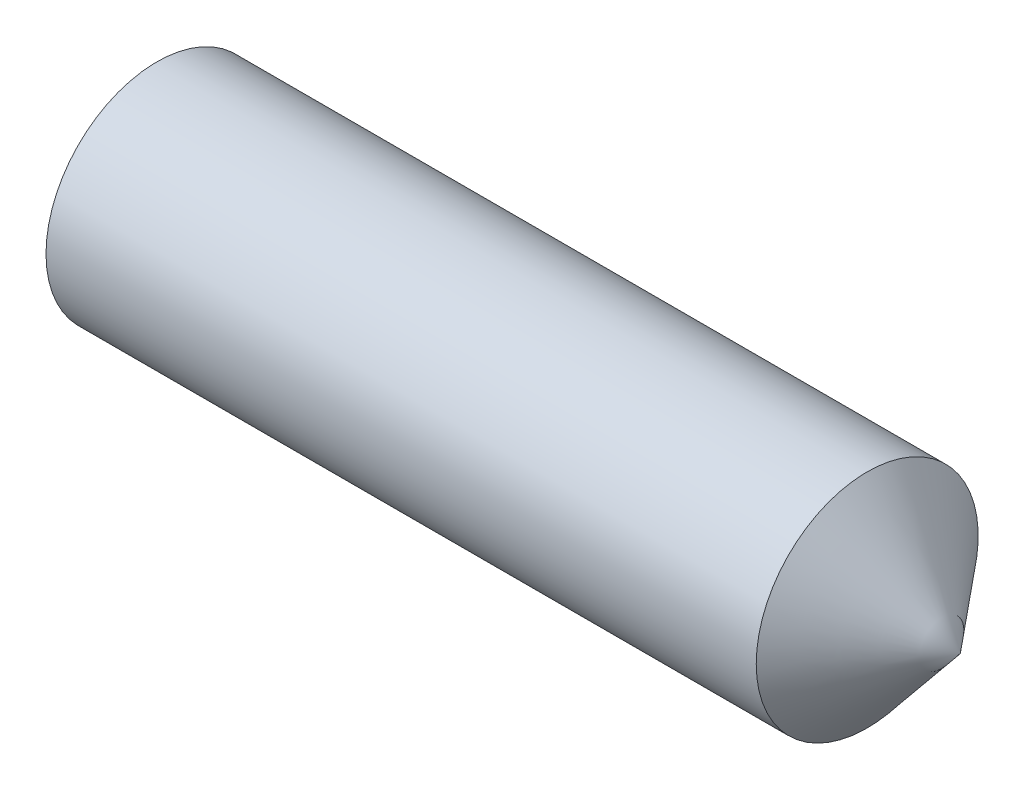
ISO-10303-21;
HEADER;
FILE_DESCRIPTION(('STEP AP214'),'2;1');
FILE_NAME('part.step','',(''),(''),'','','');
FILE_SCHEMA(('AUTOMOTIVE_DESIGN { 1 0 10303 214 1 1 1 1 }'));
ENDSEC;
DATA;
#1=APPLICATION_CONTEXT('core data for automotive mechanical design processes');
#2=APPLICATION_PROTOCOL_DEFINITION('international standard','automotive_design',2000,#1);
#3=PRODUCT_CONTEXT('',#1,'mechanical');
#4=PRODUCT('Part','Part','',(#3));
#5=PRODUCT_RELATED_PRODUCT_CATEGORY('part','',(#4));
#6=PRODUCT_DEFINITION_FORMATION('','',#4);
#7=PRODUCT_DEFINITION_CONTEXT('part definition',#1,'design');
#8=PRODUCT_DEFINITION('design','',#6,#7);
#9=PRODUCT_DEFINITION_SHAPE('','',#8);
#10=(LENGTH_UNIT() NAMED_UNIT(*) SI_UNIT(.MILLI.,.METRE.));
#11=(NAMED_UNIT(*) PLANE_ANGLE_UNIT() SI_UNIT($,.RADIAN.));
#12=(NAMED_UNIT(*) SI_UNIT($,.STERADIAN.) SOLID_ANGLE_UNIT());
#13=UNCERTAINTY_MEASURE_WITH_UNIT(LENGTH_MEASURE(1.E-05),#10,'distance_accuracy_value','');
#14=(GEOMETRIC_REPRESENTATION_CONTEXT(3) GLOBAL_UNCERTAINTY_ASSIGNED_CONTEXT((#13)) GLOBAL_UNIT_ASSIGNED_CONTEXT((#10,
#11,#12)) REPRESENTATION_CONTEXT('',''));
#15=CARTESIAN_POINT('',(0.,0.,0.));
#16=DIRECTION('',(0.,0.,1.));
#17=DIRECTION('',(1.,0.,0.));
#18=AXIS2_PLACEMENT_3D('',#15,#16,#17);
#19=CARTESIAN_POINT('',(-40.,3.,0.));
#20=DIRECTION('',(1.,0.,0.));
#21=DIRECTION('',(0.,0.,-1.));
#22=AXIS2_PLACEMENT_3D('',#19,#20,#21);
#23=PLANE('',#22);
#24=CARTESIAN_POINT('',(-40.,0.,0.));
#25=DIRECTION('',(-1.,0.,0.));
#26=DIRECTION('',(0.,0.,1.));
#27=AXIS2_PLACEMENT_3D('',#24,#25,#26);
#28=CIRCLE('',#27,3.);
#29=CARTESIAN_POINT('',(-40.,0.,3.));
#30=VERTEX_POINT('',#29);
#31=EDGE_CURVE('E38',#30,#30,#28,.T.);
#32=ORIENTED_EDGE('',*,*,#31,.T.);
#33=EDGE_LOOP('',(#32));
#34=FACE_BOUND('',#33,.T.);
#35=ADVANCED_FACE('F32',(#34),#23,.F.);
#36=CARTESIAN_POINT('',(-18.2827011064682,0.,0.));
#37=DIRECTION('',(-1.,0.,0.));
#38=DIRECTION('',(0.,0.,1.));
#39=AXIS2_PLACEMENT_3D('',#36,#37,#38);
#40=CONICAL_SURFACE('',#39,0.,0.872664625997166);
#41=CARTESIAN_POINT('',(-20.8,0.,0.));
#42=DIRECTION('',(-1.,0.,0.));
#43=DIRECTION('',(0.,0.,1.));
#44=AXIS2_PLACEMENT_3D('',#41,#42,#43);
#45=CIRCLE('',#44,3.);
#46=CARTESIAN_POINT('',(-20.8,0.,3.));
#47=VERTEX_POINT('',#46);
#48=EDGE_CURVE('E11',#47,#47,#45,.T.);
#49=ORIENTED_EDGE('',*,*,#48,.F.);
#50=EDGE_LOOP('',(#49));
#51=FACE_BOUND('',#50,.T.);
#52=CARTESIAN_POINT('',(-18.2827011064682,0.,0.));
#53=VERTEX_POINT('',#52);
#54=VERTEX_LOOP('',#53);
#55=FACE_BOUND('',#54,.T.);
#56=ADVANCED_FACE('F41',(#51,#55),#40,.T.);
#57=CARTESIAN_POINT('',(-50.,0.,0.));
#58=DIRECTION('',(-1.,0.,0.));
#59=DIRECTION('',(0.,0.,1.));
#60=AXIS2_PLACEMENT_3D('',#57,#58,#59);
#61=CYLINDRICAL_SURFACE('',#60,3.);
#62=ORIENTED_EDGE('',*,*,#31,.F.);
#63=EDGE_LOOP('',(#62));
#64=FACE_BOUND('',#63,.T.);
#65=ORIENTED_EDGE('',*,*,#48,.T.);
#66=EDGE_LOOP('',(#65));
#67=FACE_BOUND('',#66,.T.);
#68=ADVANCED_FACE('F43',(#64,#67),#61,.T.);
#69=CLOSED_SHELL('',(#35,#56,#68));
#70=MANIFOLD_SOLID_BREP('B2',#69);
#71=ADVANCED_BREP_SHAPE_REPRESENTATION('',(#18,#70),#14);
#72=SHAPE_DEFINITION_REPRESENTATION(#9,#71);
ENDSEC;
END-ISO-10303-21;
